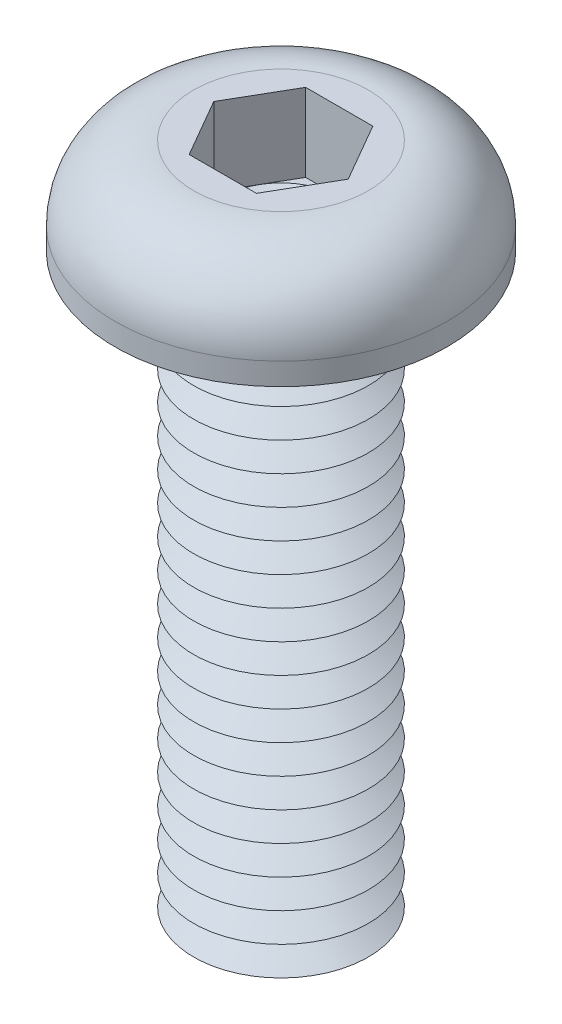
ISO-10303-21;
HEADER;
FILE_DESCRIPTION(('STEP AP214'),'2;1');
FILE_NAME('part.step','',(''),(''),'','','');
FILE_SCHEMA(('AUTOMOTIVE_DESIGN { 1 0 10303 214 1 1 1 1 }'));
ENDSEC;
DATA;
#1=APPLICATION_CONTEXT('core data for automotive mechanical design processes');
#2=APPLICATION_PROTOCOL_DEFINITION('international standard','automotive_design',2000,#1);
#3=PRODUCT_CONTEXT('',#1,'mechanical');
#4=PRODUCT('Part','Part','',(#3));
#5=PRODUCT_RELATED_PRODUCT_CATEGORY('part','',(#4));
#6=PRODUCT_DEFINITION_FORMATION('','',#4);
#7=PRODUCT_DEFINITION_CONTEXT('part definition',#1,'design');
#8=PRODUCT_DEFINITION('design','',#6,#7);
#9=PRODUCT_DEFINITION_SHAPE('','',#8);
#10=(LENGTH_UNIT() NAMED_UNIT(*) SI_UNIT(.MILLI.,.METRE.));
#11=(NAMED_UNIT(*) PLANE_ANGLE_UNIT() SI_UNIT($,.RADIAN.));
#12=(NAMED_UNIT(*) SI_UNIT($,.STERADIAN.) SOLID_ANGLE_UNIT());
#13=UNCERTAINTY_MEASURE_WITH_UNIT(LENGTH_MEASURE(1.E-05),#10,'distance_accuracy_value','');
#14=(GEOMETRIC_REPRESENTATION_CONTEXT(3) GLOBAL_UNCERTAINTY_ASSIGNED_CONTEXT((#13)) GLOBAL_UNIT_ASSIGNED_CONTEXT((#10,
#11,#12)) REPRESENTATION_CONTEXT('',''));
#15=CARTESIAN_POINT('',(0.,0.,0.));
#16=DIRECTION('',(0.,0.,1.));
#17=DIRECTION('',(1.,0.,0.));
#18=AXIS2_PLACEMENT_3D('',#15,#16,#17);
#19=CARTESIAN_POINT('',(0.,0.,0.));
#20=DIRECTION('',(0.,-1.,0.));
#21=DIRECTION('',(0.,0.,-1.));
#22=AXIS2_PLACEMENT_3D('',#19,#20,#21);
#23=TOROIDAL_SURFACE('',#22,1.75,0.25);
#24=CARTESIAN_POINT('',(0.,0.,-2.));
#25=VERTEX_POINT('',#24);
#26=VERTEX_LOOP('',#25);
#27=FACE_BOUND('',#26,.T.);
#28=ADVANCED_FACE('P0_F12',(#27),#23,.T.);
#29=CLOSED_SHELL('',(#28));
#30=MANIFOLD_SOLID_BREP('P0_B1',#29);
#31=CARTESIAN_POINT('',(0.577350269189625,0.31,-1.));
#32=DIRECTION('',(0.,1.,0.));
#33=DIRECTION('',(0.,0.,1.));
#34=AXIS2_PLACEMENT_3D('',#31,#32,#33);
#35=PLANE('',#34);
#36=CARTESIAN_POINT('',(0.,0.31,0.));
#37=DIRECTION('',(0.,1.,0.));
#38=DIRECTION('',(0.,0.,1.));
#39=AXIS2_PLACEMENT_3D('',#36,#37,#38);
#40=CIRCLE('',#39,1.);
#41=CARTESIAN_POINT('',(0.,0.31,1.));
#42=VERTEX_POINT('',#41);
#43=CARTESIAN_POINT('',(0.866025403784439,0.31,0.5));
#44=VERTEX_POINT('',#43);
#45=EDGE_CURVE('P1_E93',#42,#44,#40,.T.);
#46=ORIENTED_EDGE('',*,*,#45,.F.);
#47=DIRECTION('',(1.,0.,0.));
#48=VECTOR('',#47,1.);
#49=CARTESIAN_POINT('',(-0.577350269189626,0.31,1.));
#50=LINE('',#49,#48);
#51=CARTESIAN_POINT('',(0.577350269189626,0.31,1.));
#52=VERTEX_POINT('',#51);
#53=EDGE_CURVE('P1_E116',#42,#52,#50,.T.);
#54=ORIENTED_EDGE('',*,*,#53,.T.);
#55=DIRECTION('',(0.5,0.,-0.866025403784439));
#56=VECTOR('',#55,1.);
#57=CARTESIAN_POINT('',(0.577350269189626,0.31,1.));
#58=LINE('',#57,#56);
#59=EDGE_CURVE('P1_E112',#52,#44,#58,.T.);
#60=ORIENTED_EDGE('',*,*,#59,.T.);
#61=EDGE_LOOP('',(#46,#54,#60));
#62=FACE_BOUND('',#61,.T.);
#63=ADVANCED_FACE('P1_F15',(#62),#35,.T.);
#64=CARTESIAN_POINT('',(0.,0.31,0.));
#65=DIRECTION('',(0.,1.,0.));
#66=DIRECTION('',(0.,0.,1.));
#67=AXIS2_PLACEMENT_3D('',#64,#65,#66);
#68=CIRCLE('',#67,1.);
#69=CARTESIAN_POINT('',(0.866025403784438,0.31,-0.5));
#70=VERTEX_POINT('',#69);
#71=EDGE_CURVE('P1_E10',#44,#70,#68,.T.);
#72=ORIENTED_EDGE('',*,*,#71,.F.);
#73=CARTESIAN_POINT('',(1.15470053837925,0.31,0.));
#74=VERTEX_POINT('',#73);
#75=EDGE_CURVE('P1_E104',#44,#74,#58,.T.);
#76=ORIENTED_EDGE('',*,*,#75,.T.);
#77=DIRECTION('',(-0.5,0.,-0.866025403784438));
#78=VECTOR('',#77,1.);
#79=CARTESIAN_POINT('',(1.15470053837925,0.31,0.));
#80=LINE('',#79,#78);
#81=EDGE_CURVE('P1_E107',#74,#70,#80,.T.);
#82=ORIENTED_EDGE('',*,*,#81,.T.);
#83=EDGE_LOOP('',(#72,#76,#82));
#84=FACE_BOUND('',#83,.T.);
#85=ADVANCED_FACE('P1_F103',(#84),#35,.T.);
#86=CARTESIAN_POINT('',(0.,0.31,-1.));
#87=VERTEX_POINT('',#86);
#88=EDGE_CURVE('P1_E24',#70,#87,#68,.T.);
#89=ORIENTED_EDGE('',*,*,#88,.F.);
#90=CARTESIAN_POINT('',(0.577350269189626,0.31,-1.));
#91=VERTEX_POINT('',#90);
#92=EDGE_CURVE('P1_E139',#70,#91,#80,.T.);
#93=ORIENTED_EDGE('',*,*,#92,.T.);
#94=DIRECTION('',(-1.,0.,0.));
#95=VECTOR('',#94,1.);
#96=CARTESIAN_POINT('',(0.577350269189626,0.31,-1.));
#97=LINE('',#96,#95);
#98=EDGE_CURVE('P1_E336',#91,#87,#97,.T.);
#99=ORIENTED_EDGE('',*,*,#98,.T.);
#100=EDGE_LOOP('',(#89,#93,#99));
#101=FACE_BOUND('',#100,.T.);
#102=ADVANCED_FACE('P1_F301',(#101),#35,.T.);
#103=CARTESIAN_POINT('',(-0.866025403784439,0.31,-0.5));
#104=VERTEX_POINT('',#103);
#105=EDGE_CURVE('P1_E331',#87,#104,#68,.T.);
#106=ORIENTED_EDGE('',*,*,#105,.F.);
#107=CARTESIAN_POINT('',(-0.577350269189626,0.31,-1.));
#108=VERTEX_POINT('',#107);
#109=EDGE_CURVE('P1_E340',#87,#108,#97,.T.);
#110=ORIENTED_EDGE('',*,*,#109,.T.);
#111=DIRECTION('',(-0.5,0.,0.866025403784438));
#112=VECTOR('',#111,1.);
#113=CARTESIAN_POINT('',(-0.577350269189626,0.31,-1.));
#114=LINE('',#113,#112);
#115=EDGE_CURVE('P1_E335',#108,#104,#114,.T.);
#116=ORIENTED_EDGE('',*,*,#115,.T.);
#117=EDGE_LOOP('',(#106,#110,#116));
#118=FACE_BOUND('',#117,.T.);
#119=ADVANCED_FACE('P1_F315',(#118),#35,.T.);
#120=CARTESIAN_POINT('',(-0.866025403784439,0.31,0.5));
#121=VERTEX_POINT('',#120);
#122=EDGE_CURVE('P1_E31',#104,#121,#68,.T.);
#123=ORIENTED_EDGE('',*,*,#122,.F.);
#124=CARTESIAN_POINT('',(-1.15470053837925,0.31,0.));
#125=VERTEX_POINT('',#124);
#126=EDGE_CURVE('P1_E327',#104,#125,#114,.T.);
#127=ORIENTED_EDGE('',*,*,#126,.T.);
#128=DIRECTION('',(0.5,0.,0.866025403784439));
#129=VECTOR('',#128,1.);
#130=CARTESIAN_POINT('',(-1.15470053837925,0.31,0.));
#131=LINE('',#130,#129);
#132=EDGE_CURVE('P1_E330',#125,#121,#131,.T.);
#133=ORIENTED_EDGE('',*,*,#132,.T.);
#134=EDGE_LOOP('',(#123,#127,#133));
#135=FACE_BOUND('',#134,.T.);
#136=ADVANCED_FACE('P1_F306',(#135),#35,.T.);
#137=CARTESIAN_POINT('',(0.,-9.5,0.));
#138=DIRECTION('',(0.,1.,0.));
#139=DIRECTION('',(0.,0.,1.));
#140=AXIS2_PLACEMENT_3D('',#137,#138,#139);
#141=CONICAL_SURFACE('',#140,1.06698729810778,1.0471975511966);
#142=CARTESIAN_POINT('',(0.,-9.25,0.));
#143=DIRECTION('',(0.,-1.,0.));
#144=DIRECTION('',(0.,0.,-1.));
#145=AXIS2_PLACEMENT_3D('',#142,#143,#144);
#146=CIRCLE('',#145,1.5);
#147=CARTESIAN_POINT('',(0.,-9.25,-1.5));
#148=VERTEX_POINT('',#147);
#149=EDGE_CURVE('P1_E263',#148,#148,#146,.T.);
#150=ORIENTED_EDGE('',*,*,#149,.T.);
#151=EDGE_LOOP('',(#150));
#152=FACE_BOUND('',#151,.T.);
#153=CARTESIAN_POINT('',(0.,-9.5,0.));
#154=DIRECTION('',(0.,-1.,0.));
#155=DIRECTION('',(0.,0.,-1.));
#156=AXIS2_PLACEMENT_3D('',#153,#154,#155);
#157=CIRCLE('',#156,1.06698729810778);
#158=CARTESIAN_POINT('',(0.,-9.5,-1.06698729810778));
#159=VERTEX_POINT('',#158);
#160=EDGE_CURVE('P1_E266',#159,#159,#157,.T.);
#161=ORIENTED_EDGE('',*,*,#160,.F.);
#162=EDGE_LOOP('',(#161));
#163=FACE_BOUND('',#162,.T.);
#164=ADVANCED_FACE('P1_F314',(#152,#163),#141,.T.);
#165=CARTESIAN_POINT('',(0.,-9.75,0.));
#166=DIRECTION('',(0.,-1.,0.));
#167=DIRECTION('',(0.,0.,-1.));
#168=AXIS2_PLACEMENT_3D('',#165,#166,#167);
#169=CONICAL_SURFACE('',#168,1.5,1.0471975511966);
#170=ORIENTED_EDGE('',*,*,#160,.T.);
#171=EDGE_LOOP('',(#170));
#172=FACE_BOUND('',#171,.T.);
#173=CARTESIAN_POINT('',(0.,-9.75,0.));
#174=DIRECTION('',(0.,-1.,0.));
#175=DIRECTION('',(0.,0.,-1.));
#176=AXIS2_PLACEMENT_3D('',#173,#174,#175);
#177=CIRCLE('',#176,1.5);
#178=CARTESIAN_POINT('',(0.,-9.75,-1.5));
#179=VERTEX_POINT('',#178);
#180=EDGE_CURVE('P1_E269',#179,#179,#177,.T.);
#181=ORIENTED_EDGE('',*,*,#180,.F.);
#182=EDGE_LOOP('',(#181));
#183=FACE_BOUND('',#182,.T.);
#184=ADVANCED_FACE('P1_F321',(#172,#183),#169,.T.);
#185=CARTESIAN_POINT('',(0.,-10.,0.));
#186=DIRECTION('',(0.,1.,0.));
#187=DIRECTION('',(0.,0.,1.));
#188=AXIS2_PLACEMENT_3D('',#185,#186,#187);
#189=PLANE('',#188);
#190=CARTESIAN_POINT('',(0.,-10.,0.));
#191=DIRECTION('',(0.,-1.,0.));
#192=DIRECTION('',(0.,0.,-1.));
#193=AXIS2_PLACEMENT_3D('',#190,#191,#192);
#194=CIRCLE('',#193,1.06698729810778);
#195=CARTESIAN_POINT('',(0.,-10.,-1.06698729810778));
#196=VERTEX_POINT('',#195);
#197=EDGE_CURVE('P1_E272',#196,#196,#194,.T.);
#198=ORIENTED_EDGE('',*,*,#197,.T.);
#199=EDGE_LOOP('',(#198));
#200=FACE_BOUND('',#199,.T.);
#201=ADVANCED_FACE('P1_F399',(#200),#189,.F.);
#202=CARTESIAN_POINT('',(0.,-10.,0.));
#203=DIRECTION('',(0.,1.,0.));
#204=DIRECTION('',(0.,0.,1.));
#205=AXIS2_PLACEMENT_3D('',#202,#203,#204);
#206=CONICAL_SURFACE('',#205,1.06698729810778,1.0471975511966);
#207=ORIENTED_EDGE('',*,*,#180,.T.);
#208=EDGE_LOOP('',(#207));
#209=FACE_BOUND('',#208,.T.);
#210=ORIENTED_EDGE('',*,*,#197,.F.);
#211=EDGE_LOOP('',(#210));
#212=FACE_BOUND('',#211,.T.);
#213=ADVANCED_FACE('P1_F410',(#209,#212),#206,.T.);
#214=CARTESIAN_POINT('',(0.,-9.,0.));
#215=DIRECTION('',(0.,1.,0.));
#216=DIRECTION('',(0.,0.,1.));
#217=AXIS2_PLACEMENT_3D('',#214,#215,#216);
#218=CONICAL_SURFACE('',#217,1.06698729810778,1.0471975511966);
#219=CARTESIAN_POINT('',(0.,-8.75,0.));
#220=DIRECTION('',(0.,-1.,0.));
#221=DIRECTION('',(0.,0.,-1.));
#222=AXIS2_PLACEMENT_3D('',#219,#220,#221);
#223=CIRCLE('',#222,1.5);
#224=CARTESIAN_POINT('',(0.,-8.75,-1.5));
#225=VERTEX_POINT('',#224);
#226=EDGE_CURVE('P1_E257',#225,#225,#223,.T.);
#227=ORIENTED_EDGE('',*,*,#226,.T.);
#228=EDGE_LOOP('',(#227));
#229=FACE_BOUND('',#228,.T.);
#230=CARTESIAN_POINT('',(0.,-9.,0.));
#231=DIRECTION('',(0.,-1.,0.));
#232=DIRECTION('',(0.,0.,-1.));
#233=AXIS2_PLACEMENT_3D('',#230,#231,#232);
#234=CIRCLE('',#233,1.06698729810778);
#235=CARTESIAN_POINT('',(0.,-9.,-1.06698729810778));
#236=VERTEX_POINT('',#235);
#237=EDGE_CURVE('P1_E260',#236,#236,#234,.T.);
#238=ORIENTED_EDGE('',*,*,#237,.F.);
#239=EDGE_LOOP('',(#238));
#240=FACE_BOUND('',#239,.T.);
#241=ADVANCED_FACE('P1_F419',(#229,#240),#218,.T.);
#242=CARTESIAN_POINT('',(0.,-9.25,0.));
#243=DIRECTION('',(0.,-1.,0.));
#244=DIRECTION('',(0.,0.,-1.));
#245=AXIS2_PLACEMENT_3D('',#242,#243,#244);
#246=CONICAL_SURFACE('',#245,1.5,1.0471975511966);
#247=ORIENTED_EDGE('',*,*,#237,.T.);
#248=EDGE_LOOP('',(#247));
#249=FACE_BOUND('',#248,.T.);
#250=ORIENTED_EDGE('',*,*,#149,.F.);
#251=EDGE_LOOP('',(#250));
#252=FACE_BOUND('',#251,.T.);
#253=ADVANCED_FACE('P1_F428',(#249,#252),#246,.T.);
#254=CARTESIAN_POINT('',(0.,-8.5,0.));
#255=DIRECTION('',(0.,1.,0.));
#256=DIRECTION('',(0.,0.,1.));
#257=AXIS2_PLACEMENT_3D('',#254,#255,#256);
#258=CONICAL_SURFACE('',#257,1.06698729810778,1.0471975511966);
#259=CARTESIAN_POINT('',(0.,-8.25,0.));
#260=DIRECTION('',(0.,-1.,0.));
#261=DIRECTION('',(0.,0.,-1.));
#262=AXIS2_PLACEMENT_3D('',#259,#260,#261);
#263=CIRCLE('',#262,1.5);
#264=CARTESIAN_POINT('',(0.,-8.25,-1.5));
#265=VERTEX_POINT('',#264);
#266=EDGE_CURVE('P1_E251',#265,#265,#263,.T.);
#267=ORIENTED_EDGE('',*,*,#266,.T.);
#268=EDGE_LOOP('',(#267));
#269=FACE_BOUND('',#268,.T.);
#270=CARTESIAN_POINT('',(0.,-8.5,0.));
#271=DIRECTION('',(0.,-1.,0.));
#272=DIRECTION('',(0.,0.,-1.));
#273=AXIS2_PLACEMENT_3D('',#270,#271,#272);
#274=CIRCLE('',#273,1.06698729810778);
#275=CARTESIAN_POINT('',(0.,-8.5,-1.06698729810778));
#276=VERTEX_POINT('',#275);
#277=EDGE_CURVE('P1_E254',#276,#276,#274,.T.);
#278=ORIENTED_EDGE('',*,*,#277,.F.);
#279=EDGE_LOOP('',(#278));
#280=FACE_BOUND('',#279,.T.);
#281=ADVANCED_FACE('P1_F438',(#269,#280),#258,.T.);
#282=CARTESIAN_POINT('',(0.,-8.75,0.));
#283=DIRECTION('',(0.,-1.,0.));
#284=DIRECTION('',(0.,0.,-1.));
#285=AXIS2_PLACEMENT_3D('',#282,#283,#284);
#286=CONICAL_SURFACE('',#285,1.5,1.0471975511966);
#287=ORIENTED_EDGE('',*,*,#277,.T.);
#288=EDGE_LOOP('',(#287));
#289=FACE_BOUND('',#288,.T.);
#290=ORIENTED_EDGE('',*,*,#226,.F.);
#291=EDGE_LOOP('',(#290));
#292=FACE_BOUND('',#291,.T.);
#293=ADVANCED_FACE('P1_F448',(#289,#292),#286,.T.);
#294=CARTESIAN_POINT('',(0.,-8.,0.));
#295=DIRECTION('',(0.,1.,0.));
#296=DIRECTION('',(0.,0.,1.));
#297=AXIS2_PLACEMENT_3D('',#294,#295,#296);
#298=CONICAL_SURFACE('',#297,1.06698729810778,1.0471975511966);
#299=CARTESIAN_POINT('',(0.,-7.75,0.));
#300=DIRECTION('',(0.,-1.,0.));
#301=DIRECTION('',(0.,0.,-1.));
#302=AXIS2_PLACEMENT_3D('',#299,#300,#301);
#303=CIRCLE('',#302,1.5);
#304=CARTESIAN_POINT('',(0.,-7.75,-1.5));
#305=VERTEX_POINT('',#304);
#306=EDGE_CURVE('P1_E245',#305,#305,#303,.T.);
#307=ORIENTED_EDGE('',*,*,#306,.T.);
#308=EDGE_LOOP('',(#307));
#309=FACE_BOUND('',#308,.T.);
#310=CARTESIAN_POINT('',(0.,-8.,0.));
#311=DIRECTION('',(0.,-1.,0.));
#312=DIRECTION('',(0.,0.,-1.));
#313=AXIS2_PLACEMENT_3D('',#310,#311,#312);
#314=CIRCLE('',#313,1.06698729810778);
#315=CARTESIAN_POINT('',(0.,-8.,-1.06698729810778));
#316=VERTEX_POINT('',#315);
#317=EDGE_CURVE('P1_E248',#316,#316,#314,.T.);
#318=ORIENTED_EDGE('',*,*,#317,.F.);
#319=EDGE_LOOP('',(#318));
#320=FACE_BOUND('',#319,.T.);
#321=ADVANCED_FACE('P1_F458',(#309,#320),#298,.T.);
#322=CARTESIAN_POINT('',(0.,-8.25,0.));
#323=DIRECTION('',(0.,-1.,0.));
#324=DIRECTION('',(0.,0.,-1.));
#325=AXIS2_PLACEMENT_3D('',#322,#323,#324);
#326=CONICAL_SURFACE('',#325,1.5,1.0471975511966);
#327=ORIENTED_EDGE('',*,*,#317,.T.);
#328=EDGE_LOOP('',(#327));
#329=FACE_BOUND('',#328,.T.);
#330=ORIENTED_EDGE('',*,*,#266,.F.);
#331=EDGE_LOOP('',(#330));
#332=FACE_BOUND('',#331,.T.);
#333=ADVANCED_FACE('P1_F468',(#329,#332),#326,.T.);
#334=CARTESIAN_POINT('',(0.,-7.5,0.));
#335=DIRECTION('',(0.,1.,0.));
#336=DIRECTION('',(0.,0.,1.));
#337=AXIS2_PLACEMENT_3D('',#334,#335,#336);
#338=CONICAL_SURFACE('',#337,1.06698729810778,1.0471975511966);
#339=CARTESIAN_POINT('',(0.,-7.25,0.));
#340=DIRECTION('',(0.,-1.,0.));
#341=DIRECTION('',(0.,0.,-1.));
#342=AXIS2_PLACEMENT_3D('',#339,#340,#341);
#343=CIRCLE('',#342,1.5);
#344=CARTESIAN_POINT('',(0.,-7.25,-1.5));
#345=VERTEX_POINT('',#344);
#346=EDGE_CURVE('P1_E239',#345,#345,#343,.T.);
#347=ORIENTED_EDGE('',*,*,#346,.T.);
#348=EDGE_LOOP('',(#347));
#349=FACE_BOUND('',#348,.T.);
#350=CARTESIAN_POINT('',(0.,-7.5,0.));
#351=DIRECTION('',(0.,-1.,0.));
#352=DIRECTION('',(0.,0.,-1.));
#353=AXIS2_PLACEMENT_3D('',#350,#351,#352);
#354=CIRCLE('',#353,1.06698729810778);
#355=CARTESIAN_POINT('',(0.,-7.5,-1.06698729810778));
#356=VERTEX_POINT('',#355);
#357=EDGE_CURVE('P1_E242',#356,#356,#354,.T.);
#358=ORIENTED_EDGE('',*,*,#357,.F.);
#359=EDGE_LOOP('',(#358));
#360=FACE_BOUND('',#359,.T.);
#361=ADVANCED_FACE('P1_F478',(#349,#360),#338,.T.);
#362=CARTESIAN_POINT('',(0.,-7.75,0.));
#363=DIRECTION('',(0.,-1.,0.));
#364=DIRECTION('',(0.,0.,-1.));
#365=AXIS2_PLACEMENT_3D('',#362,#363,#364);
#366=CONICAL_SURFACE('',#365,1.5,1.0471975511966);
#367=ORIENTED_EDGE('',*,*,#357,.T.);
#368=EDGE_LOOP('',(#367));
#369=FACE_BOUND('',#368,.T.);
#370=ORIENTED_EDGE('',*,*,#306,.F.);
#371=EDGE_LOOP('',(#370));
#372=FACE_BOUND('',#371,.T.);
#373=ADVANCED_FACE('P1_F488',(#369,#372),#366,.T.);
#374=CARTESIAN_POINT('',(0.,-7.,0.));
#375=DIRECTION('',(0.,1.,0.));
#376=DIRECTION('',(0.,0.,1.));
#377=AXIS2_PLACEMENT_3D('',#374,#375,#376);
#378=CONICAL_SURFACE('',#377,1.06698729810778,1.0471975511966);
#379=CARTESIAN_POINT('',(0.,-6.75,0.));
#380=DIRECTION('',(0.,-1.,0.));
#381=DIRECTION('',(0.,0.,-1.));
#382=AXIS2_PLACEMENT_3D('',#379,#380,#381);
#383=CIRCLE('',#382,1.5);
#384=CARTESIAN_POINT('',(0.,-6.75,-1.5));
#385=VERTEX_POINT('',#384);
#386=EDGE_CURVE('P1_E233',#385,#385,#383,.T.);
#387=ORIENTED_EDGE('',*,*,#386,.T.);
#388=EDGE_LOOP('',(#387));
#389=FACE_BOUND('',#388,.T.);
#390=CARTESIAN_POINT('',(0.,-7.,0.));
#391=DIRECTION('',(0.,-1.,0.));
#392=DIRECTION('',(0.,0.,-1.));
#393=AXIS2_PLACEMENT_3D('',#390,#391,#392);
#394=CIRCLE('',#393,1.06698729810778);
#395=CARTESIAN_POINT('',(0.,-7.,-1.06698729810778));
#396=VERTEX_POINT('',#395);
#397=EDGE_CURVE('P1_E236',#396,#396,#394,.T.);
#398=ORIENTED_EDGE('',*,*,#397,.F.);
#399=EDGE_LOOP('',(#398));
#400=FACE_BOUND('',#399,.T.);
#401=ADVANCED_FACE('P1_F498',(#389,#400),#378,.T.);
#402=CARTESIAN_POINT('',(0.,-7.25,0.));
#403=DIRECTION('',(0.,-1.,0.));
#404=DIRECTION('',(0.,0.,-1.));
#405=AXIS2_PLACEMENT_3D('',#402,#403,#404);
#406=CONICAL_SURFACE('',#405,1.5,1.0471975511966);
#407=ORIENTED_EDGE('',*,*,#397,.T.);
#408=EDGE_LOOP('',(#407));
#409=FACE_BOUND('',#408,.T.);
#410=ORIENTED_EDGE('',*,*,#346,.F.);
#411=EDGE_LOOP('',(#410));
#412=FACE_BOUND('',#411,.T.);
#413=ADVANCED_FACE('P1_F508',(#409,#412),#406,.T.);
#414=CARTESIAN_POINT('',(0.,-6.5,0.));
#415=DIRECTION('',(0.,1.,0.));
#416=DIRECTION('',(0.,0.,1.));
#417=AXIS2_PLACEMENT_3D('',#414,#415,#416);
#418=CONICAL_SURFACE('',#417,1.06698729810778,1.0471975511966);
#419=CARTESIAN_POINT('',(0.,-6.25,0.));
#420=DIRECTION('',(0.,-1.,0.));
#421=DIRECTION('',(0.,0.,-1.));
#422=AXIS2_PLACEMENT_3D('',#419,#420,#421);
#423=CIRCLE('',#422,1.5);
#424=CARTESIAN_POINT('',(0.,-6.25,-1.5));
#425=VERTEX_POINT('',#424);
#426=EDGE_CURVE('P1_E227',#425,#425,#423,.T.);
#427=ORIENTED_EDGE('',*,*,#426,.T.);
#428=EDGE_LOOP('',(#427));
#429=FACE_BOUND('',#428,.T.);
#430=CARTESIAN_POINT('',(0.,-6.5,0.));
#431=DIRECTION('',(0.,-1.,0.));
#432=DIRECTION('',(0.,0.,-1.));
#433=AXIS2_PLACEMENT_3D('',#430,#431,#432);
#434=CIRCLE('',#433,1.06698729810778);
#435=CARTESIAN_POINT('',(0.,-6.5,-1.06698729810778));
#436=VERTEX_POINT('',#435);
#437=EDGE_CURVE('P1_E230',#436,#436,#434,.T.);
#438=ORIENTED_EDGE('',*,*,#437,.F.);
#439=EDGE_LOOP('',(#438));
#440=FACE_BOUND('',#439,.T.);
#441=ADVANCED_FACE('P1_F518',(#429,#440),#418,.T.);
#442=CARTESIAN_POINT('',(0.,-6.75,0.));
#443=DIRECTION('',(0.,-1.,0.));
#444=DIRECTION('',(0.,0.,-1.));
#445=AXIS2_PLACEMENT_3D('',#442,#443,#444);
#446=CONICAL_SURFACE('',#445,1.5,1.0471975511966);
#447=ORIENTED_EDGE('',*,*,#437,.T.);
#448=EDGE_LOOP('',(#447));
#449=FACE_BOUND('',#448,.T.);
#450=ORIENTED_EDGE('',*,*,#386,.F.);
#451=EDGE_LOOP('',(#450));
#452=FACE_BOUND('',#451,.T.);
#453=ADVANCED_FACE('P1_F528',(#449,#452),#446,.T.);
#454=CARTESIAN_POINT('',(0.,-6.,0.));
#455=DIRECTION('',(0.,1.,0.));
#456=DIRECTION('',(0.,0.,1.));
#457=AXIS2_PLACEMENT_3D('',#454,#455,#456);
#458=CONICAL_SURFACE('',#457,1.06698729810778,1.0471975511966);
#459=CARTESIAN_POINT('',(0.,-5.75,0.));
#460=DIRECTION('',(0.,-1.,0.));
#461=DIRECTION('',(0.,0.,-1.));
#462=AXIS2_PLACEMENT_3D('',#459,#460,#461);
#463=CIRCLE('',#462,1.5);
#464=CARTESIAN_POINT('',(0.,-5.75,-1.5));
#465=VERTEX_POINT('',#464);
#466=EDGE_CURVE('P1_E221',#465,#465,#463,.T.);
#467=ORIENTED_EDGE('',*,*,#466,.T.);
#468=EDGE_LOOP('',(#467));
#469=FACE_BOUND('',#468,.T.);
#470=CARTESIAN_POINT('',(0.,-6.,0.));
#471=DIRECTION('',(0.,-1.,0.));
#472=DIRECTION('',(0.,0.,-1.));
#473=AXIS2_PLACEMENT_3D('',#470,#471,#472);
#474=CIRCLE('',#473,1.06698729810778);
#475=CARTESIAN_POINT('',(0.,-6.,-1.06698729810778));
#476=VERTEX_POINT('',#475);
#477=EDGE_CURVE('P1_E224',#476,#476,#474,.T.);
#478=ORIENTED_EDGE('',*,*,#477,.F.);
#479=EDGE_LOOP('',(#478));
#480=FACE_BOUND('',#479,.T.);
#481=ADVANCED_FACE('P1_F538',(#469,#480),#458,.T.);
#482=CARTESIAN_POINT('',(0.,-6.25,0.));
#483=DIRECTION('',(0.,-1.,0.));
#484=DIRECTION('',(0.,0.,-1.));
#485=AXIS2_PLACEMENT_3D('',#482,#483,#484);
#486=CONICAL_SURFACE('',#485,1.5,1.0471975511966);
#487=ORIENTED_EDGE('',*,*,#477,.T.);
#488=EDGE_LOOP('',(#487));
#489=FACE_BOUND('',#488,.T.);
#490=ORIENTED_EDGE('',*,*,#426,.F.);
#491=EDGE_LOOP('',(#490));
#492=FACE_BOUND('',#491,.T.);
#493=ADVANCED_FACE('P1_F548',(#489,#492),#486,.T.);
#494=CARTESIAN_POINT('',(0.,-5.5,0.));
#495=DIRECTION('',(0.,1.,0.));
#496=DIRECTION('',(0.,0.,1.));
#497=AXIS2_PLACEMENT_3D('',#494,#495,#496);
#498=CONICAL_SURFACE('',#497,1.06698729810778,1.0471975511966);
#499=CARTESIAN_POINT('',(0.,-5.25,0.));
#500=DIRECTION('',(0.,-1.,0.));
#501=DIRECTION('',(0.,0.,-1.));
#502=AXIS2_PLACEMENT_3D('',#499,#500,#501);
#503=CIRCLE('',#502,1.5);
#504=CARTESIAN_POINT('',(0.,-5.25,-1.5));
#505=VERTEX_POINT('',#504);
#506=EDGE_CURVE('P1_E215',#505,#505,#503,.T.);
#507=ORIENTED_EDGE('',*,*,#506,.T.);
#508=EDGE_LOOP('',(#507));
#509=FACE_BOUND('',#508,.T.);
#510=CARTESIAN_POINT('',(0.,-5.5,0.));
#511=DIRECTION('',(0.,-1.,0.));
#512=DIRECTION('',(0.,0.,-1.));
#513=AXIS2_PLACEMENT_3D('',#510,#511,#512);
#514=CIRCLE('',#513,1.06698729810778);
#515=CARTESIAN_POINT('',(0.,-5.5,-1.06698729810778));
#516=VERTEX_POINT('',#515);
#517=EDGE_CURVE('P1_E218',#516,#516,#514,.T.);
#518=ORIENTED_EDGE('',*,*,#517,.F.);
#519=EDGE_LOOP('',(#518));
#520=FACE_BOUND('',#519,.T.);
#521=ADVANCED_FACE('P1_F558',(#509,#520),#498,.T.);
#522=CARTESIAN_POINT('',(0.,-5.75,0.));
#523=DIRECTION('',(0.,-1.,0.));
#524=DIRECTION('',(0.,0.,-1.));
#525=AXIS2_PLACEMENT_3D('',#522,#523,#524);
#526=CONICAL_SURFACE('',#525,1.5,1.0471975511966);
#527=ORIENTED_EDGE('',*,*,#517,.T.);
#528=EDGE_LOOP('',(#527));
#529=FACE_BOUND('',#528,.T.);
#530=ORIENTED_EDGE('',*,*,#466,.F.);
#531=EDGE_LOOP('',(#530));
#532=FACE_BOUND('',#531,.T.);
#533=ADVANCED_FACE('P1_F568',(#529,#532),#526,.T.);
#534=CARTESIAN_POINT('',(0.,-5.,0.));
#535=DIRECTION('',(0.,1.,0.));
#536=DIRECTION('',(0.,0.,1.));
#537=AXIS2_PLACEMENT_3D('',#534,#535,#536);
#538=CONICAL_SURFACE('',#537,1.06698729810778,1.0471975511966);
#539=CARTESIAN_POINT('',(0.,-4.75,0.));
#540=DIRECTION('',(0.,-1.,0.));
#541=DIRECTION('',(0.,0.,-1.));
#542=AXIS2_PLACEMENT_3D('',#539,#540,#541);
#543=CIRCLE('',#542,1.5);
#544=CARTESIAN_POINT('',(0.,-4.75,-1.5));
#545=VERTEX_POINT('',#544);
#546=EDGE_CURVE('P1_E209',#545,#545,#543,.T.);
#547=ORIENTED_EDGE('',*,*,#546,.T.);
#548=EDGE_LOOP('',(#547));
#549=FACE_BOUND('',#548,.T.);
#550=CARTESIAN_POINT('',(0.,-5.,0.));
#551=DIRECTION('',(0.,-1.,0.));
#552=DIRECTION('',(0.,0.,-1.));
#553=AXIS2_PLACEMENT_3D('',#550,#551,#552);
#554=CIRCLE('',#553,1.06698729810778);
#555=CARTESIAN_POINT('',(0.,-5.,-1.06698729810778));
#556=VERTEX_POINT('',#555);
#557=EDGE_CURVE('P1_E212',#556,#556,#554,.T.);
#558=ORIENTED_EDGE('',*,*,#557,.F.);
#559=EDGE_LOOP('',(#558));
#560=FACE_BOUND('',#559,.T.);
#561=ADVANCED_FACE('P1_F578',(#549,#560),#538,.T.);
#562=CARTESIAN_POINT('',(0.,-5.25,0.));
#563=DIRECTION('',(0.,-1.,0.));
#564=DIRECTION('',(0.,0.,-1.));
#565=AXIS2_PLACEMENT_3D('',#562,#563,#564);
#566=CONICAL_SURFACE('',#565,1.5,1.0471975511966);
#567=ORIENTED_EDGE('',*,*,#557,.T.);
#568=EDGE_LOOP('',(#567));
#569=FACE_BOUND('',#568,.T.);
#570=ORIENTED_EDGE('',*,*,#506,.F.);
#571=EDGE_LOOP('',(#570));
#572=FACE_BOUND('',#571,.T.);
#573=ADVANCED_FACE('P1_F588',(#569,#572),#566,.T.);
#574=CARTESIAN_POINT('',(0.,-4.5,0.));
#575=DIRECTION('',(0.,1.,0.));
#576=DIRECTION('',(0.,0.,1.));
#577=AXIS2_PLACEMENT_3D('',#574,#575,#576);
#578=CONICAL_SURFACE('',#577,1.06698729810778,1.0471975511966);
#579=CARTESIAN_POINT('',(0.,-4.25,0.));
#580=DIRECTION('',(0.,-1.,0.));
#581=DIRECTION('',(0.,0.,-1.));
#582=AXIS2_PLACEMENT_3D('',#579,#580,#581);
#583=CIRCLE('',#582,1.5);
#584=CARTESIAN_POINT('',(0.,-4.25,-1.5));
#585=VERTEX_POINT('',#584);
#586=EDGE_CURVE('P1_E203',#585,#585,#583,.T.);
#587=ORIENTED_EDGE('',*,*,#586,.T.);
#588=EDGE_LOOP('',(#587));
#589=FACE_BOUND('',#588,.T.);
#590=CARTESIAN_POINT('',(0.,-4.5,0.));
#591=DIRECTION('',(0.,-1.,0.));
#592=DIRECTION('',(0.,0.,-1.));
#593=AXIS2_PLACEMENT_3D('',#590,#591,#592);
#594=CIRCLE('',#593,1.06698729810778);
#595=CARTESIAN_POINT('',(0.,-4.5,-1.06698729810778));
#596=VERTEX_POINT('',#595);
#597=EDGE_CURVE('P1_E206',#596,#596,#594,.T.);
#598=ORIENTED_EDGE('',*,*,#597,.F.);
#599=EDGE_LOOP('',(#598));
#600=FACE_BOUND('',#599,.T.);
#601=ADVANCED_FACE('P1_F598',(#589,#600),#578,.T.);
#602=CARTESIAN_POINT('',(0.,-4.75,0.));
#603=DIRECTION('',(0.,-1.,0.));
#604=DIRECTION('',(0.,0.,-1.));
#605=AXIS2_PLACEMENT_3D('',#602,#603,#604);
#606=CONICAL_SURFACE('',#605,1.5,1.0471975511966);
#607=ORIENTED_EDGE('',*,*,#597,.T.);
#608=EDGE_LOOP('',(#607));
#609=FACE_BOUND('',#608,.T.);
#610=ORIENTED_EDGE('',*,*,#546,.F.);
#611=EDGE_LOOP('',(#610));
#612=FACE_BOUND('',#611,.T.);
#613=ADVANCED_FACE('P1_F608',(#609,#612),#606,.T.);
#614=CARTESIAN_POINT('',(0.,-4.,0.));
#615=DIRECTION('',(0.,1.,0.));
#616=DIRECTION('',(0.,0.,1.));
#617=AXIS2_PLACEMENT_3D('',#614,#615,#616);
#618=CONICAL_SURFACE('',#617,1.06698729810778,1.0471975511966);
#619=CARTESIAN_POINT('',(0.,-3.75,0.));
#620=DIRECTION('',(0.,-1.,0.));
#621=DIRECTION('',(0.,0.,-1.));
#622=AXIS2_PLACEMENT_3D('',#619,#620,#621);
#623=CIRCLE('',#622,1.5);
#624=CARTESIAN_POINT('',(0.,-3.75,-1.5));
#625=VERTEX_POINT('',#624);
#626=EDGE_CURVE('P1_E197',#625,#625,#623,.T.);
#627=ORIENTED_EDGE('',*,*,#626,.T.);
#628=EDGE_LOOP('',(#627));
#629=FACE_BOUND('',#628,.T.);
#630=CARTESIAN_POINT('',(0.,-4.,0.));
#631=DIRECTION('',(0.,-1.,0.));
#632=DIRECTION('',(0.,0.,-1.));
#633=AXIS2_PLACEMENT_3D('',#630,#631,#632);
#634=CIRCLE('',#633,1.06698729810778);
#635=CARTESIAN_POINT('',(0.,-4.,-1.06698729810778));
#636=VERTEX_POINT('',#635);
#637=EDGE_CURVE('P1_E200',#636,#636,#634,.T.);
#638=ORIENTED_EDGE('',*,*,#637,.F.);
#639=EDGE_LOOP('',(#638));
#640=FACE_BOUND('',#639,.T.);
#641=ADVANCED_FACE('P1_F618',(#629,#640),#618,.T.);
#642=CARTESIAN_POINT('',(0.,-4.25,0.));
#643=DIRECTION('',(0.,-1.,0.));
#644=DIRECTION('',(0.,0.,-1.));
#645=AXIS2_PLACEMENT_3D('',#642,#643,#644);
#646=CONICAL_SURFACE('',#645,1.5,1.0471975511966);
#647=ORIENTED_EDGE('',*,*,#637,.T.);
#648=EDGE_LOOP('',(#647));
#649=FACE_BOUND('',#648,.T.);
#650=ORIENTED_EDGE('',*,*,#586,.F.);
#651=EDGE_LOOP('',(#650));
#652=FACE_BOUND('',#651,.T.);
#653=ADVANCED_FACE('P1_F628',(#649,#652),#646,.T.);
#654=CARTESIAN_POINT('',(0.,-3.5,0.));
#655=DIRECTION('',(0.,1.,0.));
#656=DIRECTION('',(0.,0.,1.));
#657=AXIS2_PLACEMENT_3D('',#654,#655,#656);
#658=CONICAL_SURFACE('',#657,1.06698729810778,1.0471975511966);
#659=CARTESIAN_POINT('',(0.,-3.25,0.));
#660=DIRECTION('',(0.,-1.,0.));
#661=DIRECTION('',(0.,0.,-1.));
#662=AXIS2_PLACEMENT_3D('',#659,#660,#661);
#663=CIRCLE('',#662,1.5);
#664=CARTESIAN_POINT('',(0.,-3.25,-1.5));
#665=VERTEX_POINT('',#664);
#666=EDGE_CURVE('P1_E191',#665,#665,#663,.T.);
#667=ORIENTED_EDGE('',*,*,#666,.T.);
#668=EDGE_LOOP('',(#667));
#669=FACE_BOUND('',#668,.T.);
#670=CARTESIAN_POINT('',(0.,-3.5,0.));
#671=DIRECTION('',(0.,-1.,0.));
#672=DIRECTION('',(0.,0.,-1.));
#673=AXIS2_PLACEMENT_3D('',#670,#671,#672);
#674=CIRCLE('',#673,1.06698729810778);
#675=CARTESIAN_POINT('',(0.,-3.5,-1.06698729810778));
#676=VERTEX_POINT('',#675);
#677=EDGE_CURVE('P1_E194',#676,#676,#674,.T.);
#678=ORIENTED_EDGE('',*,*,#677,.F.);
#679=EDGE_LOOP('',(#678));
#680=FACE_BOUND('',#679,.T.);
#681=ADVANCED_FACE('P1_F638',(#669,#680),#658,.T.);
#682=CARTESIAN_POINT('',(0.,-3.75,0.));
#683=DIRECTION('',(0.,-1.,0.));
#684=DIRECTION('',(0.,0.,-1.));
#685=AXIS2_PLACEMENT_3D('',#682,#683,#684);
#686=CONICAL_SURFACE('',#685,1.5,1.0471975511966);
#687=ORIENTED_EDGE('',*,*,#677,.T.);
#688=EDGE_LOOP('',(#687));
#689=FACE_BOUND('',#688,.T.);
#690=ORIENTED_EDGE('',*,*,#626,.F.);
#691=EDGE_LOOP('',(#690));
#692=FACE_BOUND('',#691,.T.);
#693=ADVANCED_FACE('P1_F648',(#689,#692),#686,.T.);
#694=CARTESIAN_POINT('',(0.,-3.,0.));
#695=DIRECTION('',(0.,1.,0.));
#696=DIRECTION('',(0.,0.,1.));
#697=AXIS2_PLACEMENT_3D('',#694,#695,#696);
#698=CONICAL_SURFACE('',#697,1.06698729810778,1.0471975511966);
#699=CARTESIAN_POINT('',(0.,-2.75,0.));
#700=DIRECTION('',(0.,-1.,0.));
#701=DIRECTION('',(0.,0.,-1.));
#702=AXIS2_PLACEMENT_3D('',#699,#700,#701);
#703=CIRCLE('',#702,1.5);
#704=CARTESIAN_POINT('',(0.,-2.75,-1.5));
#705=VERTEX_POINT('',#704);
#706=EDGE_CURVE('P1_E185',#705,#705,#703,.T.);
#707=ORIENTED_EDGE('',*,*,#706,.T.);
#708=EDGE_LOOP('',(#707));
#709=FACE_BOUND('',#708,.T.);
#710=CARTESIAN_POINT('',(0.,-3.,0.));
#711=DIRECTION('',(0.,-1.,0.));
#712=DIRECTION('',(0.,0.,-1.));
#713=AXIS2_PLACEMENT_3D('',#710,#711,#712);
#714=CIRCLE('',#713,1.06698729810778);
#715=CARTESIAN_POINT('',(0.,-3.,-1.06698729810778));
#716=VERTEX_POINT('',#715);
#717=EDGE_CURVE('P1_E188',#716,#716,#714,.T.);
#718=ORIENTED_EDGE('',*,*,#717,.F.);
#719=EDGE_LOOP('',(#718));
#720=FACE_BOUND('',#719,.T.);
#721=ADVANCED_FACE('P1_F658',(#709,#720),#698,.T.);
#722=CARTESIAN_POINT('',(0.,-3.25,0.));
#723=DIRECTION('',(0.,-1.,0.));
#724=DIRECTION('',(0.,0.,-1.));
#725=AXIS2_PLACEMENT_3D('',#722,#723,#724);
#726=CONICAL_SURFACE('',#725,1.5,1.0471975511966);
#727=ORIENTED_EDGE('',*,*,#717,.T.);
#728=EDGE_LOOP('',(#727));
#729=FACE_BOUND('',#728,.T.);
#730=ORIENTED_EDGE('',*,*,#666,.F.);
#731=EDGE_LOOP('',(#730));
#732=FACE_BOUND('',#731,.T.);
#733=ADVANCED_FACE('P1_F668',(#729,#732),#726,.T.);
#734=CARTESIAN_POINT('',(0.,-2.5,0.));
#735=DIRECTION('',(0.,1.,0.));
#736=DIRECTION('',(0.,0.,1.));
#737=AXIS2_PLACEMENT_3D('',#734,#735,#736);
#738=CONICAL_SURFACE('',#737,1.06698729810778,1.0471975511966);
#739=CARTESIAN_POINT('',(0.,-2.25,0.));
#740=DIRECTION('',(0.,-1.,0.));
#741=DIRECTION('',(0.,0.,-1.));
#742=AXIS2_PLACEMENT_3D('',#739,#740,#741);
#743=CIRCLE('',#742,1.5);
#744=CARTESIAN_POINT('',(0.,-2.25,-1.5));
#745=VERTEX_POINT('',#744);
#746=EDGE_CURVE('P1_E179',#745,#745,#743,.T.);
#747=ORIENTED_EDGE('',*,*,#746,.T.);
#748=EDGE_LOOP('',(#747));
#749=FACE_BOUND('',#748,.T.);
#750=CARTESIAN_POINT('',(0.,-2.5,0.));
#751=DIRECTION('',(0.,-1.,0.));
#752=DIRECTION('',(0.,0.,-1.));
#753=AXIS2_PLACEMENT_3D('',#750,#751,#752);
#754=CIRCLE('',#753,1.06698729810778);
#755=CARTESIAN_POINT('',(0.,-2.5,-1.06698729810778));
#756=VERTEX_POINT('',#755);
#757=EDGE_CURVE('P1_E182',#756,#756,#754,.T.);
#758=ORIENTED_EDGE('',*,*,#757,.F.);
#759=EDGE_LOOP('',(#758));
#760=FACE_BOUND('',#759,.T.);
#761=ADVANCED_FACE('P1_F678',(#749,#760),#738,.T.);
#762=CARTESIAN_POINT('',(0.,-2.75,0.));
#763=DIRECTION('',(0.,-1.,0.));
#764=DIRECTION('',(0.,0.,-1.));
#765=AXIS2_PLACEMENT_3D('',#762,#763,#764);
#766=CONICAL_SURFACE('',#765,1.5,1.0471975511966);
#767=ORIENTED_EDGE('',*,*,#757,.T.);
#768=EDGE_LOOP('',(#767));
#769=FACE_BOUND('',#768,.T.);
#770=ORIENTED_EDGE('',*,*,#706,.F.);
#771=EDGE_LOOP('',(#770));
#772=FACE_BOUND('',#771,.T.);
#773=ADVANCED_FACE('P1_F688',(#769,#772),#766,.T.);
#774=CARTESIAN_POINT('',(0.,-2.,0.));
#775=DIRECTION('',(0.,1.,0.));
#776=DIRECTION('',(0.,0.,1.));
#777=AXIS2_PLACEMENT_3D('',#774,#775,#776);
#778=CONICAL_SURFACE('',#777,1.06698729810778,1.0471975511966);
#779=CARTESIAN_POINT('',(0.,-1.75,0.));
#780=DIRECTION('',(0.,-1.,0.));
#781=DIRECTION('',(0.,0.,-1.));
#782=AXIS2_PLACEMENT_3D('',#779,#780,#781);
#783=CIRCLE('',#782,1.5);
#784=CARTESIAN_POINT('',(0.,-1.75,-1.5));
#785=VERTEX_POINT('',#784);
#786=EDGE_CURVE('P1_E173',#785,#785,#783,.T.);
#787=ORIENTED_EDGE('',*,*,#786,.T.);
#788=EDGE_LOOP('',(#787));
#789=FACE_BOUND('',#788,.T.);
#790=CARTESIAN_POINT('',(0.,-2.,0.));
#791=DIRECTION('',(0.,-1.,0.));
#792=DIRECTION('',(0.,0.,-1.));
#793=AXIS2_PLACEMENT_3D('',#790,#791,#792);
#794=CIRCLE('',#793,1.06698729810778);
#795=CARTESIAN_POINT('',(0.,-2.,-1.06698729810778));
#796=VERTEX_POINT('',#795);
#797=EDGE_CURVE('P1_E176',#796,#796,#794,.T.);
#798=ORIENTED_EDGE('',*,*,#797,.F.);
#799=EDGE_LOOP('',(#798));
#800=FACE_BOUND('',#799,.T.);
#801=ADVANCED_FACE('P1_F698',(#789,#800),#778,.T.);
#802=CARTESIAN_POINT('',(0.,-2.25,0.));
#803=DIRECTION('',(0.,-1.,0.));
#804=DIRECTION('',(0.,0.,-1.));
#805=AXIS2_PLACEMENT_3D('',#802,#803,#804);
#806=CONICAL_SURFACE('',#805,1.5,1.0471975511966);
#807=ORIENTED_EDGE('',*,*,#797,.T.);
#808=EDGE_LOOP('',(#807));
#809=FACE_BOUND('',#808,.T.);
#810=ORIENTED_EDGE('',*,*,#746,.F.);
#811=EDGE_LOOP('',(#810));
#812=FACE_BOUND('',#811,.T.);
#813=ADVANCED_FACE('P1_F708',(#809,#812),#806,.T.);
#814=CARTESIAN_POINT('',(0.,-1.5,0.));
#815=DIRECTION('',(0.,1.,0.));
#816=DIRECTION('',(0.,0.,1.));
#817=AXIS2_PLACEMENT_3D('',#814,#815,#816);
#818=CONICAL_SURFACE('',#817,1.06698729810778,1.0471975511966);
#819=CARTESIAN_POINT('',(0.,-1.25,0.));
#820=DIRECTION('',(0.,-1.,0.));
#821=DIRECTION('',(0.,0.,-1.));
#822=AXIS2_PLACEMENT_3D('',#819,#820,#821);
#823=CIRCLE('',#822,1.5);
#824=CARTESIAN_POINT('',(0.,-1.25,-1.5));
#825=VERTEX_POINT('',#824);
#826=EDGE_CURVE('P1_E164',#825,#825,#823,.T.);
#827=ORIENTED_EDGE('',*,*,#826,.T.);
#828=EDGE_LOOP('',(#827));
#829=FACE_BOUND('',#828,.T.);
#830=CARTESIAN_POINT('',(0.,-1.5,0.));
#831=DIRECTION('',(0.,-1.,0.));
#832=DIRECTION('',(0.,0.,-1.));
#833=AXIS2_PLACEMENT_3D('',#830,#831,#832);
#834=CIRCLE('',#833,1.06698729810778);
#835=CARTESIAN_POINT('',(0.,-1.5,-1.06698729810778));
#836=VERTEX_POINT('',#835);
#837=EDGE_CURVE('P1_E170',#836,#836,#834,.T.);
#838=ORIENTED_EDGE('',*,*,#837,.F.);
#839=EDGE_LOOP('',(#838));
#840=FACE_BOUND('',#839,.T.);
#841=ADVANCED_FACE('P1_F718',(#829,#840),#818,.T.);
#842=CARTESIAN_POINT('',(0.,-1.75,0.));
#843=DIRECTION('',(0.,-1.,0.));
#844=DIRECTION('',(0.,0.,-1.));
#845=AXIS2_PLACEMENT_3D('',#842,#843,#844);
#846=CONICAL_SURFACE('',#845,1.5,1.0471975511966);
#847=ORIENTED_EDGE('',*,*,#837,.T.);
#848=EDGE_LOOP('',(#847));
#849=FACE_BOUND('',#848,.T.);
#850=ORIENTED_EDGE('',*,*,#786,.F.);
#851=EDGE_LOOP('',(#850));
#852=FACE_BOUND('',#851,.T.);
#853=ADVANCED_FACE('P1_F728',(#849,#852),#846,.T.);
#854=CARTESIAN_POINT('',(0.,-0.999999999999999,0.));
#855=DIRECTION('',(0.,1.,0.));
#856=DIRECTION('',(0.,0.,1.));
#857=AXIS2_PLACEMENT_3D('',#854,#855,#856);
#858=CONICAL_SURFACE('',#857,1.06698729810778,1.0471975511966);
#859=CARTESIAN_POINT('',(0.,-0.749999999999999,0.));
#860=DIRECTION('',(0.,-1.,0.));
#861=DIRECTION('',(0.,0.,-1.));
#862=AXIS2_PLACEMENT_3D('',#859,#860,#861);
#863=CIRCLE('',#862,1.5);
#864=CARTESIAN_POINT('',(0.,-0.749999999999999,-1.5));
#865=VERTEX_POINT('',#864);
#866=EDGE_CURVE('P1_E167',#865,#865,#863,.T.);
#867=ORIENTED_EDGE('',*,*,#866,.T.);
#868=EDGE_LOOP('',(#867));
#869=FACE_BOUND('',#868,.T.);
#870=CARTESIAN_POINT('',(0.,-0.999999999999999,0.));
#871=DIRECTION('',(0.,-1.,0.));
#872=DIRECTION('',(0.,0.,-1.));
#873=AXIS2_PLACEMENT_3D('',#870,#871,#872);
#874=CIRCLE('',#873,1.06698729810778);
#875=CARTESIAN_POINT('',(0.,-0.999999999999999,-1.06698729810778));
#876=VERTEX_POINT('',#875);
#877=EDGE_CURVE('P1_E161',#876,#876,#874,.T.);
#878=ORIENTED_EDGE('',*,*,#877,.F.);
#879=EDGE_LOOP('',(#878));
#880=FACE_BOUND('',#879,.T.);
#881=ADVANCED_FACE('P1_F738',(#869,#880),#858,.T.);
#882=CARTESIAN_POINT('',(0.,-1.25,0.));
#883=DIRECTION('',(0.,-1.,0.));
#884=DIRECTION('',(0.,0.,-1.));
#885=AXIS2_PLACEMENT_3D('',#882,#883,#884);
#886=CONICAL_SURFACE('',#885,1.5,1.0471975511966);
#887=ORIENTED_EDGE('',*,*,#877,.T.);
#888=EDGE_LOOP('',(#887));
#889=FACE_BOUND('',#888,.T.);
#890=ORIENTED_EDGE('',*,*,#826,.F.);
#891=EDGE_LOOP('',(#890));
#892=FACE_BOUND('',#891,.T.);
#893=ADVANCED_FACE('P1_F748',(#889,#892),#886,.T.);
#894=CARTESIAN_POINT('',(0.,-10.,0.));
#895=DIRECTION('',(0.,1.,0.));
#896=DIRECTION('',(0.,0.,1.));
#897=AXIS2_PLACEMENT_3D('',#894,#895,#896);
#898=CYLINDRICAL_SURFACE('',#897,1.5);
#899=CARTESIAN_POINT('',(0.,0.,0.));
#900=DIRECTION('',(0.,-1.,0.));
#901=DIRECTION('',(1.,0.,0.));
#902=AXIS2_PLACEMENT_3D('',#899,#900,#901);
#903=CIRCLE('',#902,1.5);
#904=CARTESIAN_POINT('',(1.5,0.,0.));
#905=VERTEX_POINT('',#904);
#906=EDGE_CURVE('P1_E141',#905,#905,#903,.F.);
#907=ORIENTED_EDGE('',*,*,#906,.F.);
#908=EDGE_LOOP('',(#907));
#909=FACE_BOUND('',#908,.T.);
#910=ORIENTED_EDGE('',*,*,#866,.F.);
#911=EDGE_LOOP('',(#910));
#912=FACE_BOUND('',#911,.T.);
#913=ADVANCED_FACE('P1_F17',(#909,#912),#898,.T.);
#914=CARTESIAN_POINT('',(0.,0.,0.));
#915=DIRECTION('',(0.,-1.,0.));
#916=DIRECTION('',(0.,0.,-1.));
#917=AXIS2_PLACEMENT_3D('',#914,#915,#916);
#918=TOROIDAL_SURFACE('',#917,1.75,0.25);
#919=ORIENTED_EDGE('',*,*,#906,.T.);
#920=EDGE_LOOP('',(#919));
#921=FACE_BOUND('',#920,.T.);
#922=CARTESIAN_POINT('',(0.,0.,0.));
#923=DIRECTION('',(0.,1.,0.));
#924=DIRECTION('',(-1.,0.,0.));
#925=AXIS2_PLACEMENT_3D('',#922,#923,#924);
#926=CIRCLE('',#925,2.);
#927=CARTESIAN_POINT('',(-2.,0.,0.));
#928=VERTEX_POINT('',#927);
#929=EDGE_CURVE('P1_E151',#928,#928,#926,.F.);
#930=ORIENTED_EDGE('',*,*,#929,.T.);
#931=EDGE_LOOP('',(#930));
#932=FACE_BOUND('',#931,.T.);
#933=ADVANCED_FACE('P1_F277',(#921,#932),#918,.F.);
#934=CARTESIAN_POINT('',(1.5,1.65,0.));
#935=DIRECTION('',(0.,-1.,0.));
#936=DIRECTION('',(1.,0.,0.));
#937=AXIS2_PLACEMENT_3D('',#934,#935,#936);
#938=PLANE('',#937);
#939=DIRECTION('',(-1.,0.,0.));
#940=VECTOR('',#939,1.);
#941=CARTESIAN_POINT('',(0.577350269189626,1.65,-1.));
#942=LINE('',#941,#940);
#943=CARTESIAN_POINT('',(0.577350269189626,1.65,-1.));
#944=VERTEX_POINT('',#943);
#945=CARTESIAN_POINT('',(-0.577350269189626,1.65,-1.));
#946=VERTEX_POINT('',#945);
#947=EDGE_CURVE('P1_E125',#944,#946,#942,.T.);
#948=ORIENTED_EDGE('',*,*,#947,.F.);
#949=DIRECTION('',(-0.5,0.,-0.866025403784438));
#950=VECTOR('',#949,1.);
#951=CARTESIAN_POINT('',(1.15470053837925,1.65,0.));
#952=LINE('',#951,#950);
#953=CARTESIAN_POINT('',(1.15470053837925,1.65,0.));
#954=VERTEX_POINT('',#953);
#955=EDGE_CURVE('P1_E39',#954,#944,#952,.T.);
#956=ORIENTED_EDGE('',*,*,#955,.F.);
#957=DIRECTION('',(0.5,0.,-0.866025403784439));
#958=VECTOR('',#957,1.);
#959=CARTESIAN_POINT('',(0.577350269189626,1.65,1.));
#960=LINE('',#959,#958);
#961=CARTESIAN_POINT('',(0.577350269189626,1.65,1.));
#962=VERTEX_POINT('',#961);
#963=EDGE_CURVE('P1_E137',#962,#954,#960,.T.);
#964=ORIENTED_EDGE('',*,*,#963,.F.);
#965=DIRECTION('',(1.,0.,0.));
#966=VECTOR('',#965,1.);
#967=CARTESIAN_POINT('',(-0.577350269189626,1.65,1.));
#968=LINE('',#967,#966);
#969=CARTESIAN_POINT('',(-0.577350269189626,1.65,1.));
#970=VERTEX_POINT('',#969);
#971=EDGE_CURVE('P1_E134',#970,#962,#968,.T.);
#972=ORIENTED_EDGE('',*,*,#971,.F.);
#973=DIRECTION('',(0.5,0.,0.866025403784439));
#974=VECTOR('',#973,1.);
#975=CARTESIAN_POINT('',(-1.15470053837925,1.65,0.));
#976=LINE('',#975,#974);
#977=CARTESIAN_POINT('',(-1.15470053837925,1.65,0.));
#978=VERTEX_POINT('',#977);
#979=EDGE_CURVE('P1_E131',#978,#970,#976,.T.);
#980=ORIENTED_EDGE('',*,*,#979,.F.);
#981=DIRECTION('',(-0.5,0.,0.866025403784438));
#982=VECTOR('',#981,1.);
#983=CARTESIAN_POINT('',(-0.577350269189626,1.65,-1.));
#984=LINE('',#983,#982);
#985=EDGE_CURVE('P1_E128',#946,#978,#984,.T.);
#986=ORIENTED_EDGE('',*,*,#985,.F.);
#987=EDGE_LOOP('',(#948,#956,#964,#972,#980,#986));
#988=FACE_BOUND('',#987,.T.);
#989=CARTESIAN_POINT('',(0.,1.65,0.));
#990=DIRECTION('',(0.,1.,0.));
#991=DIRECTION('',(-1.,0.,0.));
#992=AXIS2_PLACEMENT_3D('',#989,#990,#991);
#993=CIRCLE('',#992,1.5);
#994=CARTESIAN_POINT('',(-1.5,1.65,0.));
#995=VERTEX_POINT('',#994);
#996=EDGE_CURVE('P1_E152',#995,#995,#993,.T.);
#997=ORIENTED_EDGE('',*,*,#996,.T.);
#998=EDGE_LOOP('',(#997));
#999=FACE_BOUND('',#998,.T.);
#1000=ADVANCED_FACE('P1_F355',(#988,#999),#938,.F.);
#1001=CARTESIAN_POINT('',(0.,0.38,0.));
#1002=DIRECTION('',(0.,1.,0.));
#1003=DIRECTION('',(-1.,0.,0.));
#1004=AXIS2_PLACEMENT_3D('',#1001,#1002,#1003);
#1005=TOROIDAL_SURFACE('',#1004,1.57762962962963,1.27237037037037);
#1006=ORIENTED_EDGE('',*,*,#996,.F.);
#1007=EDGE_LOOP('',(#1006));
#1008=FACE_BOUND('',#1007,.T.);
#1009=CARTESIAN_POINT('',(0.,0.38,0.));
#1010=DIRECTION('',(0.,1.,0.));
#1011=DIRECTION('',(-1.,0.,0.));
#1012=AXIS2_PLACEMENT_3D('',#1009,#1010,#1011);
#1013=CIRCLE('',#1012,2.85);
#1014=CARTESIAN_POINT('',(-2.85,0.38,0.));
#1015=VERTEX_POINT('',#1014);
#1016=EDGE_CURVE('P1_E155',#1015,#1015,#1013,.T.);
#1017=ORIENTED_EDGE('',*,*,#1016,.T.);
#1018=EDGE_LOOP('',(#1017));
#1019=FACE_BOUND('',#1018,.T.);
#1020=ADVANCED_FACE('P1_F291',(#1008,#1019),#1005,.T.);
#1021=CARTESIAN_POINT('',(0.,1.65,0.));
#1022=DIRECTION('',(0.,1.,0.));
#1023=DIRECTION('',(-1.,0.,0.));
#1024=AXIS2_PLACEMENT_3D('',#1021,#1022,#1023);
#1025=CYLINDRICAL_SURFACE('',#1024,2.85);
#1026=ORIENTED_EDGE('',*,*,#1016,.F.);
#1027=EDGE_LOOP('',(#1026));
#1028=FACE_BOUND('',#1027,.T.);
#1029=CARTESIAN_POINT('',(0.,0.,0.));
#1030=DIRECTION('',(0.,1.,0.));
#1031=DIRECTION('',(-1.,0.,0.));
#1032=AXIS2_PLACEMENT_3D('',#1029,#1030,#1031);
#1033=CIRCLE('',#1032,2.85);
#1034=CARTESIAN_POINT('',(-2.85,0.,0.));
#1035=VERTEX_POINT('',#1034);
#1036=EDGE_CURVE('P1_E158',#1035,#1035,#1033,.T.);
#1037=ORIENTED_EDGE('',*,*,#1036,.T.);
#1038=EDGE_LOOP('',(#1037));
#1039=FACE_BOUND('',#1038,.T.);
#1040=ADVANCED_FACE('P1_F282',(#1028,#1039),#1025,.T.);
#1041=CARTESIAN_POINT('',(0.,0.,0.));
#1042=DIRECTION('',(0.,1.,0.));
#1043=DIRECTION('',(-1.,0.,0.));
#1044=AXIS2_PLACEMENT_3D('',#1041,#1042,#1043);
#1045=PLANE('',#1044);
#1046=ORIENTED_EDGE('',*,*,#1036,.F.);
#1047=EDGE_LOOP('',(#1046));
#1048=FACE_BOUND('',#1047,.T.);
#1049=ORIENTED_EDGE('',*,*,#929,.F.);
#1050=EDGE_LOOP('',(#1049));
#1051=FACE_BOUND('',#1050,.T.);
#1052=ADVANCED_FACE('P1_F279',(#1048,#1051),#1045,.F.);
#1053=CARTESIAN_POINT('',(1.15470053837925,0.31,0.));
#1054=DIRECTION('',(0.866025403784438,0.,-0.5));
#1055=DIRECTION('',(-0.5,0.,-0.866025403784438));
#1056=AXIS2_PLACEMENT_3D('',#1053,#1054,#1055);
#1057=PLANE('',#1056);
#1058=ORIENTED_EDGE('',*,*,#955,.T.);
#1059=DIRECTION('',(0.,1.,0.));
#1060=VECTOR('',#1059,1.);
#1061=CARTESIAN_POINT('',(0.577350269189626,0.31,-1.));
#1062=LINE('',#1061,#1060);
#1063=EDGE_CURVE('P1_E118',#91,#944,#1062,.T.);
#1064=ORIENTED_EDGE('',*,*,#1063,.F.);
#1065=ORIENTED_EDGE('',*,*,#92,.F.);
#1066=ORIENTED_EDGE('',*,*,#81,.F.);
#1067=DIRECTION('',(0.,1.,0.));
#1068=VECTOR('',#1067,1.);
#1069=CARTESIAN_POINT('',(1.15470053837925,0.31,0.));
#1070=LINE('',#1069,#1068);
#1071=EDGE_CURVE('P1_E113',#74,#954,#1070,.T.);
#1072=ORIENTED_EDGE('',*,*,#1071,.T.);
#1073=EDGE_LOOP('',(#1058,#1064,#1065,#1066,#1072));
#1074=FACE_BOUND('',#1073,.T.);
#1075=ADVANCED_FACE('P1_F281',(#1074),#1057,.F.);
#1076=CARTESIAN_POINT('',(0.577350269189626,0.31,1.));
#1077=DIRECTION('',(0.866025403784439,0.,0.5));
#1078=DIRECTION('',(0.5,0.,-0.866025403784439));
#1079=AXIS2_PLACEMENT_3D('',#1076,#1077,#1078);
#1080=PLANE('',#1079);
#1081=ORIENTED_EDGE('',*,*,#963,.T.);
#1082=ORIENTED_EDGE('',*,*,#1071,.F.);
#1083=ORIENTED_EDGE('',*,*,#75,.F.);
#1084=ORIENTED_EDGE('',*,*,#59,.F.);
#1085=DIRECTION('',(0.,1.,0.));
#1086=VECTOR('',#1085,1.);
#1087=CARTESIAN_POINT('',(0.577350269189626,0.31,1.));
#1088=LINE('',#1087,#1086);
#1089=EDGE_CURVE('P1_E142',#52,#962,#1088,.T.);
#1090=ORIENTED_EDGE('',*,*,#1089,.T.);
#1091=EDGE_LOOP('',(#1081,#1082,#1083,#1084,#1090));
#1092=FACE_BOUND('',#1091,.T.);
#1093=ADVANCED_FACE('P1_F111',(#1092),#1080,.F.);
#1094=CARTESIAN_POINT('',(-0.577350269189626,0.31,1.));
#1095=DIRECTION('',(0.,0.,1.));
#1096=DIRECTION('',(1.,0.,0.));
#1097=AXIS2_PLACEMENT_3D('',#1094,#1095,#1096);
#1098=PLANE('',#1097);
#1099=ORIENTED_EDGE('',*,*,#971,.T.);
#1100=ORIENTED_EDGE('',*,*,#1089,.F.);
#1101=ORIENTED_EDGE('',*,*,#53,.F.);
#1102=CARTESIAN_POINT('',(-0.577350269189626,0.31,1.));
#1103=VERTEX_POINT('',#1102);
#1104=EDGE_CURVE('P1_E114',#1103,#42,#50,.T.);
#1105=ORIENTED_EDGE('',*,*,#1104,.F.);
#1106=DIRECTION('',(0.,1.,0.));
#1107=VECTOR('',#1106,1.);
#1108=CARTESIAN_POINT('',(-0.577350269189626,0.31,1.));
#1109=LINE('',#1108,#1107);
#1110=EDGE_CURVE('P1_E144',#1103,#970,#1109,.T.);
#1111=ORIENTED_EDGE('',*,*,#1110,.T.);
#1112=EDGE_LOOP('',(#1099,#1100,#1101,#1105,#1111));
#1113=FACE_BOUND('',#1112,.T.);
#1114=ADVANCED_FACE('P1_F350',(#1113),#1098,.F.);
#1115=CARTESIAN_POINT('',(-1.15470053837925,0.31,0.));
#1116=DIRECTION('',(-0.866025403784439,0.,0.5));
#1117=DIRECTION('',(0.5,0.,0.866025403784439));
#1118=AXIS2_PLACEMENT_3D('',#1115,#1116,#1117);
#1119=PLANE('',#1118);
#1120=ORIENTED_EDGE('',*,*,#979,.T.);
#1121=ORIENTED_EDGE('',*,*,#1110,.F.);
#1122=EDGE_CURVE('P1_E342',#121,#1103,#131,.T.);
#1123=ORIENTED_EDGE('',*,*,#1122,.F.);
#1124=ORIENTED_EDGE('',*,*,#132,.F.);
#1125=DIRECTION('',(0.,1.,0.));
#1126=VECTOR('',#1125,1.);
#1127=CARTESIAN_POINT('',(-1.15470053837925,0.31,0.));
#1128=LINE('',#1127,#1126);
#1129=EDGE_CURVE('P1_E146',#125,#978,#1128,.T.);
#1130=ORIENTED_EDGE('',*,*,#1129,.T.);
#1131=EDGE_LOOP('',(#1120,#1121,#1123,#1124,#1130));
#1132=FACE_BOUND('',#1131,.T.);
#1133=ADVANCED_FACE('P1_F826',(#1132),#1119,.F.);
#1134=CARTESIAN_POINT('',(-0.577350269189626,0.31,-1.));
#1135=DIRECTION('',(-0.866025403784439,0.,-0.5));
#1136=DIRECTION('',(-0.5,0.,0.866025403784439));
#1137=AXIS2_PLACEMENT_3D('',#1134,#1135,#1136);
#1138=PLANE('',#1137);
#1139=ORIENTED_EDGE('',*,*,#985,.T.);
#1140=ORIENTED_EDGE('',*,*,#1129,.F.);
#1141=ORIENTED_EDGE('',*,*,#126,.F.);
#1142=ORIENTED_EDGE('',*,*,#115,.F.);
#1143=DIRECTION('',(0.,1.,0.));
#1144=VECTOR('',#1143,1.);
#1145=CARTESIAN_POINT('',(-0.577350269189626,0.31,-1.));
#1146=LINE('',#1145,#1144);
#1147=EDGE_CURVE('P1_E119',#108,#946,#1146,.T.);
#1148=ORIENTED_EDGE('',*,*,#1147,.T.);
#1149=EDGE_LOOP('',(#1139,#1140,#1141,#1142,#1148));
#1150=FACE_BOUND('',#1149,.T.);
#1151=ADVANCED_FACE('P1_F310',(#1150),#1138,.F.);
#1152=CARTESIAN_POINT('',(0.577350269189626,0.31,-1.));
#1153=DIRECTION('',(0.,0.,-1.));
#1154=DIRECTION('',(-1.,0.,0.));
#1155=AXIS2_PLACEMENT_3D('',#1152,#1153,#1154);
#1156=PLANE('',#1155);
#1157=ORIENTED_EDGE('',*,*,#947,.T.);
#1158=ORIENTED_EDGE('',*,*,#1147,.F.);
#1159=ORIENTED_EDGE('',*,*,#109,.F.);
#1160=ORIENTED_EDGE('',*,*,#98,.F.);
#1161=ORIENTED_EDGE('',*,*,#1063,.T.);
#1162=EDGE_LOOP('',(#1157,#1158,#1159,#1160,#1161));
#1163=FACE_BOUND('',#1162,.T.);
#1164=ADVANCED_FACE('P1_F304',(#1163),#1156,.F.);
#1165=EDGE_CURVE('P1_E19',#121,#42,#68,.T.);
#1166=ORIENTED_EDGE('',*,*,#1165,.F.);
#1167=ORIENTED_EDGE('',*,*,#1122,.T.);
#1168=ORIENTED_EDGE('',*,*,#1104,.T.);
#1169=EDGE_LOOP('',(#1166,#1167,#1168));
#1170=FACE_BOUND('',#1169,.T.);
#1171=ADVANCED_FACE('P1_F90',(#1170),#35,.T.);
#1172=CARTESIAN_POINT('',(0.,0.31,0.));
#1173=DIRECTION('',(0.,1.,0.));
#1174=DIRECTION('',(0.,0.,1.));
#1175=AXIS2_PLACEMENT_3D('',#1172,#1173,#1174);
#1176=CONICAL_SURFACE('',#1175,1.,1.0471975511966);
#1177=CARTESIAN_POINT('',(0.,-0.267350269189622,0.));
#1178=VERTEX_POINT('',#1177);
#1179=VERTEX_LOOP('',#1178);
#1180=FACE_BOUND('',#1179,.T.);
#1181=ORIENTED_EDGE('',*,*,#45,.T.);
#1182=ORIENTED_EDGE('',*,*,#71,.T.);
#1183=ORIENTED_EDGE('',*,*,#88,.T.);
#1184=ORIENTED_EDGE('',*,*,#105,.T.);
#1185=ORIENTED_EDGE('',*,*,#122,.T.);
#1186=ORIENTED_EDGE('',*,*,#1165,.T.);
#1187=EDGE_LOOP('',(#1181,#1182,#1183,#1184,#1185,#1186));
#1188=FACE_BOUND('',#1187,.T.);
#1189=ADVANCED_FACE('P1_F88',(#1180,#1188),#1176,.F.);
#1190=CLOSED_SHELL('',(#63,#85,#102,#119,#136,#164,#184,#201,#213,#241,#253,#281,#293,#321,#333,
#361,#373,#401,#413,#441,#453,#481,#493,#521,#533,#561,#573,#601,#613,#641,#653,#681,#693,#721,
#733,#761,#773,#801,#813,#841,#853,#881,#893,#913,#933,#1000,#1020,#1040,#1052,#1075,#1093,
#1114,#1133,#1151,#1164,#1171,#1189));
#1191=MANIFOLD_SOLID_BREP('P1_B1',#1190);
#1192=ADVANCED_BREP_SHAPE_REPRESENTATION('',(#18,#30,#1191),#14);
#1193=SHAPE_DEFINITION_REPRESENTATION(#9,#1192);
ENDSEC;
END-ISO-10303-21;
